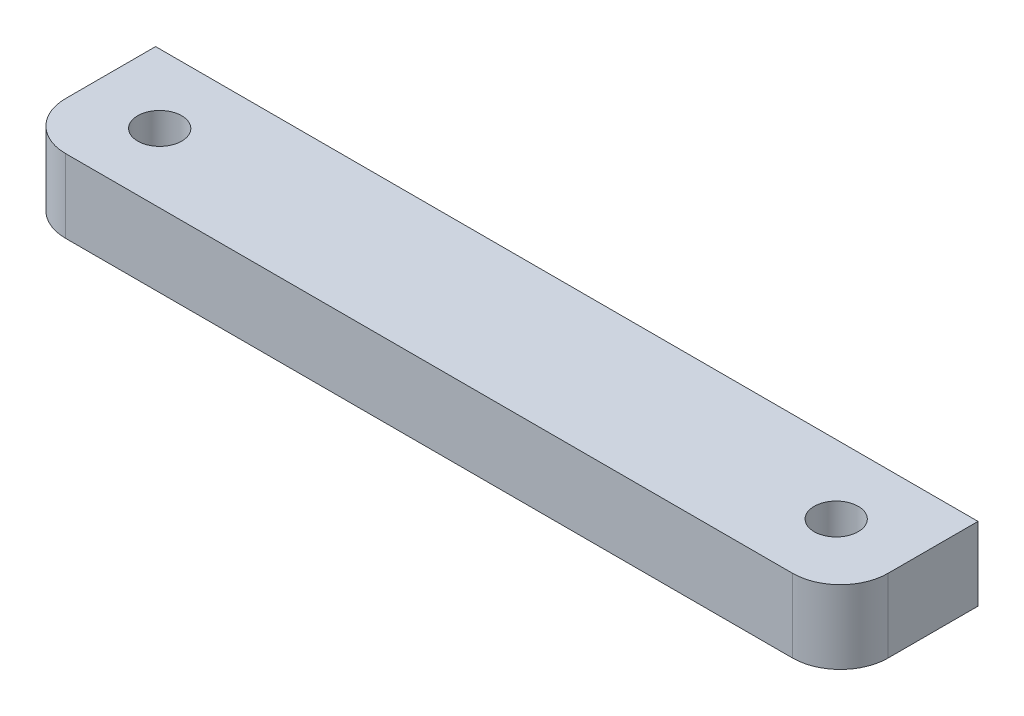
ISO-10303-21;
HEADER;
FILE_DESCRIPTION(('STEP AP214'),'2;1');
FILE_NAME('part.step','',(''),(''),'','','');
FILE_SCHEMA(('AUTOMOTIVE_DESIGN { 1 0 10303 214 1 1 1 1 }'));
ENDSEC;
DATA;
#1=APPLICATION_CONTEXT('core data for automotive mechanical design processes');
#2=APPLICATION_PROTOCOL_DEFINITION('international standard','automotive_design',2000,#1);
#3=PRODUCT_CONTEXT('',#1,'mechanical');
#4=PRODUCT('Part','Part','',(#3));
#5=PRODUCT_RELATED_PRODUCT_CATEGORY('part','',(#4));
#6=PRODUCT_DEFINITION_FORMATION('','',#4);
#7=PRODUCT_DEFINITION_CONTEXT('part definition',#1,'design');
#8=PRODUCT_DEFINITION('design','',#6,#7);
#9=PRODUCT_DEFINITION_SHAPE('','',#8);
#10=(LENGTH_UNIT() NAMED_UNIT(*) SI_UNIT(.MILLI.,.METRE.));
#11=(NAMED_UNIT(*) PLANE_ANGLE_UNIT() SI_UNIT($,.RADIAN.));
#12=(NAMED_UNIT(*) SI_UNIT($,.STERADIAN.) SOLID_ANGLE_UNIT());
#13=UNCERTAINTY_MEASURE_WITH_UNIT(LENGTH_MEASURE(1.E-05),#10,'distance_accuracy_value','');
#14=(GEOMETRIC_REPRESENTATION_CONTEXT(3) GLOBAL_UNCERTAINTY_ASSIGNED_CONTEXT((#13)) GLOBAL_UNIT_ASSIGNED_CONTEXT((#10,
#11,#12)) REPRESENTATION_CONTEXT('',''));
#15=CARTESIAN_POINT('',(0.,0.,0.));
#16=DIRECTION('',(0.,0.,1.));
#17=DIRECTION('',(1.,0.,0.));
#18=AXIS2_PLACEMENT_3D('',#15,#16,#17);
#19=CARTESIAN_POINT('',(-14.224,5.08,-4.7625));
#20=DIRECTION('',(0.,0.,1.));
#21=DIRECTION('',(1.,0.,0.));
#22=AXIS2_PLACEMENT_3D('',#19,#20,#21);
#23=PLANE('',#22);
#24=DIRECTION('',(-1.,0.,0.));
#25=VECTOR('',#24,1.);
#26=CARTESIAN_POINT('',(-14.224,0.,-4.7625));
#27=LINE('',#26,#25);
#28=CARTESIAN_POINT('',(42.672,0.,-4.76250000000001));
#29=VERTEX_POINT('',#28);
#30=CARTESIAN_POINT('',(-14.224,0.,-4.7625));
#31=VERTEX_POINT('',#30);
#32=EDGE_CURVE('E122',#29,#31,#27,.T.);
#33=ORIENTED_EDGE('',*,*,#32,.T.);
#34=DIRECTION('',(0.,-1.,0.));
#35=VECTOR('',#34,1.);
#36=CARTESIAN_POINT('',(-14.224,5.08,-4.7625));
#37=LINE('',#36,#35);
#38=CARTESIAN_POINT('',(-14.224,5.08,-4.7625));
#39=VERTEX_POINT('',#38);
#40=EDGE_CURVE('E93',#39,#31,#37,.T.);
#41=ORIENTED_EDGE('',*,*,#40,.F.);
#42=DIRECTION('',(-1.,0.,0.));
#43=VECTOR('',#42,1.);
#44=CARTESIAN_POINT('',(-14.224,5.08,-4.7625));
#45=LINE('',#44,#43);
#46=CARTESIAN_POINT('',(42.672,5.08,-4.76250000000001));
#47=VERTEX_POINT('',#46);
#48=EDGE_CURVE('E88',#47,#39,#45,.T.);
#49=ORIENTED_EDGE('',*,*,#48,.F.);
#50=DIRECTION('',(0.,-1.,0.));
#51=VECTOR('',#50,1.);
#52=CARTESIAN_POINT('',(42.672,5.08,-4.76250000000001));
#53=LINE('',#52,#51);
#54=EDGE_CURVE('E90',#47,#29,#53,.T.);
#55=ORIENTED_EDGE('',*,*,#54,.T.);
#56=EDGE_LOOP('',(#33,#41,#49,#55));
#57=FACE_BOUND('',#56,.T.);
#58=ADVANCED_FACE('F35',(#57),#23,.F.);
#59=CARTESIAN_POINT('',(-14.224,5.08,-4.7625));
#60=DIRECTION('',(1.,0.,0.));
#61=DIRECTION('',(0.,0.,-1.));
#62=AXIS2_PLACEMENT_3D('',#59,#60,#61);
#63=PLANE('',#62);
#64=DIRECTION('',(0.,0.,1.));
#65=VECTOR('',#64,1.);
#66=CARTESIAN_POINT('',(-14.224,0.,-4.7625));
#67=LINE('',#66,#65);
#68=CARTESIAN_POINT('',(-14.224,0.,1.4605));
#69=VERTEX_POINT('',#68);
#70=EDGE_CURVE('E129',#31,#69,#67,.T.);
#71=ORIENTED_EDGE('',*,*,#70,.T.);
#72=DIRECTION('',(0.,-1.,0.));
#73=VECTOR('',#72,1.);
#74=CARTESIAN_POINT('',(-14.224,5.08,1.4605));
#75=LINE('',#74,#73);
#76=CARTESIAN_POINT('',(-14.224,5.08,1.4605));
#77=VERTEX_POINT('',#76);
#78=EDGE_CURVE('E139',#69,#77,#75,.F.);
#79=ORIENTED_EDGE('',*,*,#78,.T.);
#80=DIRECTION('',(0.,0.,1.));
#81=VECTOR('',#80,1.);
#82=CARTESIAN_POINT('',(-14.224,5.08,-4.7625));
#83=LINE('',#82,#81);
#84=EDGE_CURVE('E98',#39,#77,#83,.T.);
#85=ORIENTED_EDGE('',*,*,#84,.F.);
#86=ORIENTED_EDGE('',*,*,#40,.T.);
#87=EDGE_LOOP('',(#71,#79,#85,#86));
#88=FACE_BOUND('',#87,.T.);
#89=ADVANCED_FACE('F149',(#88),#63,.F.);
#90=CARTESIAN_POINT('',(-14.224,5.08,4.7625));
#91=DIRECTION('',(0.,0.,-1.));
#92=DIRECTION('',(-1.,0.,0.));
#93=AXIS2_PLACEMENT_3D('',#90,#91,#92);
#94=PLANE('',#93);
#95=DIRECTION('',(1.,0.,0.));
#96=VECTOR('',#95,1.);
#97=CARTESIAN_POINT('',(-14.224,0.,4.7625));
#98=LINE('',#97,#96);
#99=CARTESIAN_POINT('',(-10.922,0.,4.7625));
#100=VERTEX_POINT('',#99);
#101=CARTESIAN_POINT('',(39.37,0.,4.7625));
#102=VERTEX_POINT('',#101);
#103=EDGE_CURVE('E99',#100,#102,#98,.T.);
#104=ORIENTED_EDGE('',*,*,#103,.T.);
#105=DIRECTION('',(0.,-1.,0.));
#106=VECTOR('',#105,1.);
#107=CARTESIAN_POINT('',(39.37,5.08,4.7625));
#108=LINE('',#107,#106);
#109=CARTESIAN_POINT('',(39.37,5.08,4.7625));
#110=VERTEX_POINT('',#109);
#111=EDGE_CURVE('E43',#102,#110,#108,.F.);
#112=ORIENTED_EDGE('',*,*,#111,.T.);
#113=DIRECTION('',(1.,0.,0.));
#114=VECTOR('',#113,1.);
#115=CARTESIAN_POINT('',(-14.224,5.08,4.7625));
#116=LINE('',#115,#114);
#117=CARTESIAN_POINT('',(-10.922,5.08,4.7625));
#118=VERTEX_POINT('',#117);
#119=EDGE_CURVE('E126',#118,#110,#116,.T.);
#120=ORIENTED_EDGE('',*,*,#119,.F.);
#121=DIRECTION('',(0.,-1.,0.));
#122=VECTOR('',#121,1.);
#123=CARTESIAN_POINT('',(-10.922,5.08,4.7625));
#124=LINE('',#123,#122);
#125=EDGE_CURVE('E134',#118,#100,#124,.T.);
#126=ORIENTED_EDGE('',*,*,#125,.T.);
#127=EDGE_LOOP('',(#104,#112,#120,#126));
#128=FACE_BOUND('',#127,.T.);
#129=ADVANCED_FACE('F155',(#128),#94,.F.);
#130=CARTESIAN_POINT('',(0.,5.08,0.));
#131=DIRECTION('',(0.,1.,0.));
#132=DIRECTION('',(0.,0.,1.));
#133=AXIS2_PLACEMENT_3D('',#130,#131,#132);
#134=PLANE('',#133);
#135=CARTESIAN_POINT('',(37.62502,5.08,0.));
#136=DIRECTION('',(0.,-1.,0.));
#137=DIRECTION('',(0.,0.,1.));
#138=AXIS2_PLACEMENT_3D('',#135,#136,#137);
#139=CIRCLE('',#138,1.524);
#140=CARTESIAN_POINT('',(37.62502,5.08,1.52399999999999));
#141=VERTEX_POINT('',#140);
#142=EDGE_CURVE('E116',#141,#141,#139,.T.);
#143=ORIENTED_EDGE('',*,*,#142,.T.);
#144=EDGE_LOOP('',(#143));
#145=FACE_BOUND('',#144,.T.);
#146=CARTESIAN_POINT('',(-9.17701999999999,5.08,0.));
#147=DIRECTION('',(0.,1.,0.));
#148=DIRECTION('',(0.,0.,1.));
#149=AXIS2_PLACEMENT_3D('',#146,#147,#148);
#150=CIRCLE('',#149,1.524);
#151=CARTESIAN_POINT('',(-9.17701999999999,5.08,1.524));
#152=VERTEX_POINT('',#151);
#153=EDGE_CURVE('E108',#152,#152,#150,.T.);
#154=ORIENTED_EDGE('',*,*,#153,.F.);
#155=EDGE_LOOP('',(#154));
#156=FACE_BOUND('',#155,.T.);
#157=ORIENTED_EDGE('',*,*,#119,.T.);
#158=CARTESIAN_POINT('',(39.37,5.08,1.4605));
#159=DIRECTION('',(0.,1.,0.));
#160=DIRECTION('',(0.,0.,1.));
#161=AXIS2_PLACEMENT_3D('',#158,#159,#160);
#162=CIRCLE('',#161,3.302);
#163=CARTESIAN_POINT('',(42.672,5.08,1.4605));
#164=VERTEX_POINT('',#163);
#165=EDGE_CURVE('E11',#110,#164,#162,.T.);
#166=ORIENTED_EDGE('',*,*,#165,.T.);
#167=DIRECTION('',(0.,0.,1.));
#168=VECTOR('',#167,1.);
#169=CARTESIAN_POINT('',(42.672,5.08,-4.76250000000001));
#170=LINE('',#169,#168);
#171=EDGE_CURVE('E105',#47,#164,#170,.T.);
#172=ORIENTED_EDGE('',*,*,#171,.F.);
#173=ORIENTED_EDGE('',*,*,#48,.T.);
#174=ORIENTED_EDGE('',*,*,#84,.T.);
#175=CARTESIAN_POINT('',(-10.922,5.08,1.4605));
#176=DIRECTION('',(0.,1.,0.));
#177=DIRECTION('',(0.,0.,1.));
#178=AXIS2_PLACEMENT_3D('',#175,#176,#177);
#179=CIRCLE('',#178,3.302);
#180=EDGE_CURVE('E141',#77,#118,#179,.T.);
#181=ORIENTED_EDGE('',*,*,#180,.T.);
#182=EDGE_LOOP('',(#157,#166,#172,#173,#174,#181));
#183=FACE_BOUND('',#182,.T.);
#184=ADVANCED_FACE('F110',(#145,#156,#183),#134,.T.);
#185=CARTESIAN_POINT('',(0.,0.,0.));
#186=DIRECTION('',(0.,1.,0.));
#187=DIRECTION('',(0.,0.,1.));
#188=AXIS2_PLACEMENT_3D('',#185,#186,#187);
#189=PLANE('',#188);
#190=CARTESIAN_POINT('',(37.62502,0.,0.));
#191=DIRECTION('',(0.,-1.,0.));
#192=DIRECTION('',(0.,0.,1.));
#193=AXIS2_PLACEMENT_3D('',#190,#191,#192);
#194=CIRCLE('',#193,1.524);
#195=CARTESIAN_POINT('',(37.62502,0.,1.52399999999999));
#196=VERTEX_POINT('',#195);
#197=EDGE_CURVE('E113',#196,#196,#194,.T.);
#198=ORIENTED_EDGE('',*,*,#197,.F.);
#199=EDGE_LOOP('',(#198));
#200=FACE_BOUND('',#199,.T.);
#201=CARTESIAN_POINT('',(-9.17701999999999,0.,0.));
#202=DIRECTION('',(0.,1.,0.));
#203=DIRECTION('',(0.,0.,1.));
#204=AXIS2_PLACEMENT_3D('',#201,#202,#203);
#205=CIRCLE('',#204,1.524);
#206=CARTESIAN_POINT('',(-9.17701999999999,0.,1.524));
#207=VERTEX_POINT('',#206);
#208=EDGE_CURVE('E119',#207,#207,#205,.T.);
#209=ORIENTED_EDGE('',*,*,#208,.T.);
#210=EDGE_LOOP('',(#209));
#211=FACE_BOUND('',#210,.T.);
#212=DIRECTION('',(0.,0.,1.));
#213=VECTOR('',#212,1.);
#214=CARTESIAN_POINT('',(42.672,0.,-4.76250000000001));
#215=LINE('',#214,#213);
#216=CARTESIAN_POINT('',(42.672,0.,1.4605));
#217=VERTEX_POINT('',#216);
#218=EDGE_CURVE('E107',#29,#217,#215,.T.);
#219=ORIENTED_EDGE('',*,*,#218,.T.);
#220=CARTESIAN_POINT('',(39.37,0.,1.4605));
#221=DIRECTION('',(0.,1.,0.));
#222=DIRECTION('',(0.,0.,1.));
#223=AXIS2_PLACEMENT_3D('',#220,#221,#222);
#224=CIRCLE('',#223,3.302);
#225=EDGE_CURVE('E57',#217,#102,#224,.F.);
#226=ORIENTED_EDGE('',*,*,#225,.T.);
#227=ORIENTED_EDGE('',*,*,#103,.F.);
#228=CARTESIAN_POINT('',(-10.922,0.,1.4605));
#229=DIRECTION('',(0.,1.,0.));
#230=DIRECTION('',(0.,0.,1.));
#231=AXIS2_PLACEMENT_3D('',#228,#229,#230);
#232=CIRCLE('',#231,3.302);
#233=EDGE_CURVE('E137',#100,#69,#232,.F.);
#234=ORIENTED_EDGE('',*,*,#233,.T.);
#235=ORIENTED_EDGE('',*,*,#70,.F.);
#236=ORIENTED_EDGE('',*,*,#32,.F.);
#237=EDGE_LOOP('',(#219,#226,#227,#234,#235,#236));
#238=FACE_BOUND('',#237,.T.);
#239=ADVANCED_FACE('F146',(#200,#211,#238),#189,.F.);
#240=CARTESIAN_POINT('',(-10.922,5.08,1.4605));
#241=DIRECTION('',(0.,-1.,0.));
#242=DIRECTION('',(0.,0.,-1.));
#243=AXIS2_PLACEMENT_3D('',#240,#241,#242);
#244=CYLINDRICAL_SURFACE('',#243,3.302);
#245=ORIENTED_EDGE('',*,*,#180,.F.);
#246=ORIENTED_EDGE('',*,*,#78,.F.);
#247=ORIENTED_EDGE('',*,*,#233,.F.);
#248=ORIENTED_EDGE('',*,*,#125,.F.);
#249=EDGE_LOOP('',(#245,#246,#247,#248));
#250=FACE_BOUND('',#249,.T.);
#251=ADVANCED_FACE('F154',(#250),#244,.T.);
#252=CARTESIAN_POINT('',(-9.17701999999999,0.,0.));
#253=DIRECTION('',(0.,1.,0.));
#254=DIRECTION('',(0.,0.,1.));
#255=AXIS2_PLACEMENT_3D('',#252,#253,#254);
#256=CYLINDRICAL_SURFACE('',#255,1.524);
#257=ORIENTED_EDGE('',*,*,#208,.F.);
#258=EDGE_LOOP('',(#257));
#259=FACE_BOUND('',#258,.T.);
#260=ORIENTED_EDGE('',*,*,#153,.T.);
#261=EDGE_LOOP('',(#260));
#262=FACE_BOUND('',#261,.T.);
#263=ADVANCED_FACE('F164',(#259,#262),#256,.F.);
#264=CARTESIAN_POINT('',(42.672,5.08,-4.76250000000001));
#265=DIRECTION('',(1.,0.,0.));
#266=DIRECTION('',(0.,0.,-1.));
#267=AXIS2_PLACEMENT_3D('',#264,#265,#266);
#268=PLANE('',#267);
#269=ORIENTED_EDGE('',*,*,#171,.T.);
#270=DIRECTION('',(0.,-1.,0.));
#271=VECTOR('',#270,1.);
#272=CARTESIAN_POINT('',(42.672,0.,1.4605));
#273=LINE('',#272,#271);
#274=EDGE_CURVE('E143',#164,#217,#273,.T.);
#275=ORIENTED_EDGE('',*,*,#274,.T.);
#276=ORIENTED_EDGE('',*,*,#218,.F.);
#277=ORIENTED_EDGE('',*,*,#54,.F.);
#278=EDGE_LOOP('',(#269,#275,#276,#277));
#279=FACE_BOUND('',#278,.T.);
#280=ADVANCED_FACE('F103',(#279),#268,.T.);
#281=CARTESIAN_POINT('',(39.37,5.08,1.4605));
#282=DIRECTION('',(0.,1.,0.));
#283=DIRECTION('',(0.,0.,1.));
#284=AXIS2_PLACEMENT_3D('',#281,#282,#283);
#285=CYLINDRICAL_SURFACE('',#284,3.302);
#286=ORIENTED_EDGE('',*,*,#165,.F.);
#287=ORIENTED_EDGE('',*,*,#111,.F.);
#288=ORIENTED_EDGE('',*,*,#225,.F.);
#289=ORIENTED_EDGE('',*,*,#274,.F.);
#290=EDGE_LOOP('',(#286,#287,#288,#289));
#291=FACE_BOUND('',#290,.T.);
#292=ADVANCED_FACE('F37',(#291),#285,.T.);
#293=CARTESIAN_POINT('',(37.62502,0.,0.));
#294=DIRECTION('',(0.,1.,0.));
#295=DIRECTION('',(0.,0.,1.));
#296=AXIS2_PLACEMENT_3D('',#293,#294,#295);
#297=CYLINDRICAL_SURFACE('',#296,1.524);
#298=ORIENTED_EDGE('',*,*,#197,.T.);
#299=EDGE_LOOP('',(#298));
#300=FACE_BOUND('',#299,.T.);
#301=ORIENTED_EDGE('',*,*,#142,.F.);
#302=EDGE_LOOP('',(#301));
#303=FACE_BOUND('',#302,.T.);
#304=ADVANCED_FACE('F157',(#300,#303),#297,.F.);
#305=CLOSED_SHELL('',(#58,#89,#129,#184,#239,#251,#263,#280,#292,#304));
#306=MANIFOLD_SOLID_BREP('B2',#305);
#307=ADVANCED_BREP_SHAPE_REPRESENTATION('',(#18,#306),#14);
#308=SHAPE_DEFINITION_REPRESENTATION(#9,#307);
ENDSEC;
END-ISO-10303-21;
